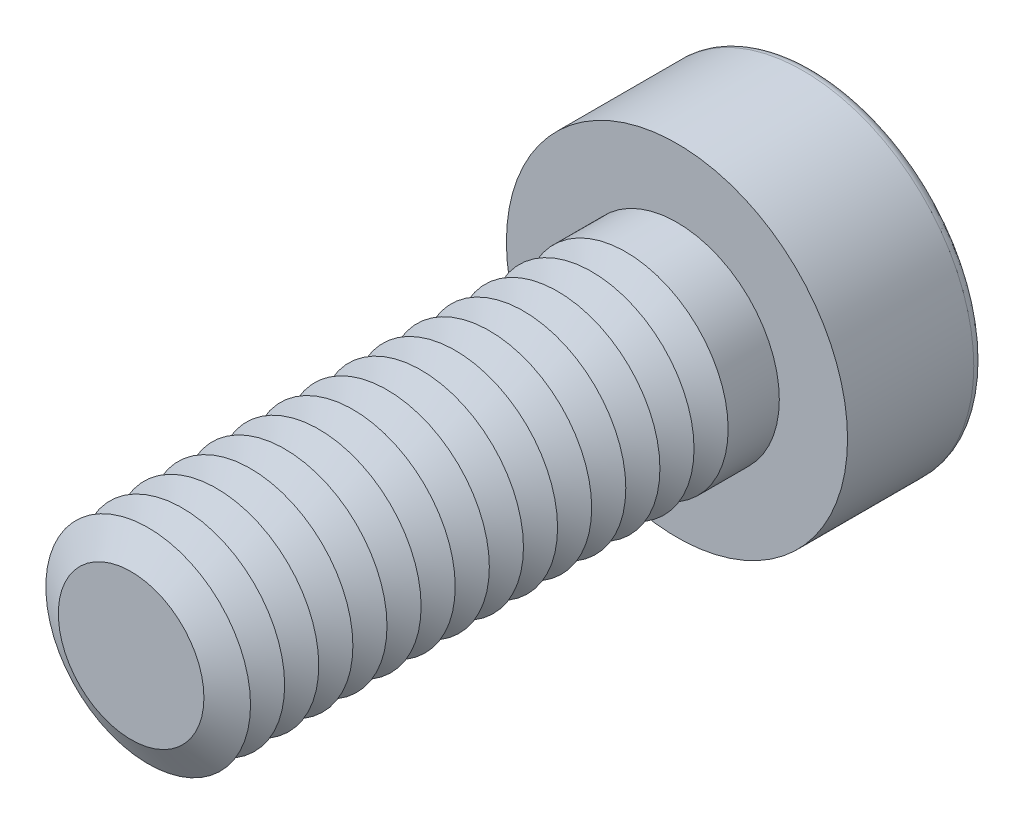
from build123d import *

# Parameters (mm, degrees)
SKETCH1_R           = 3
BOSS_EXTRUDE1_DEPTH = 16
SKETCH2_R           = 5
BOSS_EXTRUDE2_DEPTH = 4
CUT_EXTRUDE1_DEPTH  = 3
FILLET1_R           = 0.3
LPATTERN1_COUNT     = 15
LPATTERN1_PITCH     = 1


with BuildPart() as part:
    # Sketch1 → Boss-Extrude1 (new body)
    with BuildSketch(Plane.XY):
        Circle(SKETCH1_R)
    extrude(amount=BOSS_EXTRUDE1_DEPTH)

    # Sketch2 → Boss-Extrude2 (add)
    with BuildSketch(Plane(origin=(0, 0, 0), x_dir=(-1, 0, 0), z_dir=(0, 0, -1))):
        Circle(SKETCH2_R)
    extrude(amount=BOSS_EXTRUDE2_DEPTH)

    # Sketch3 → Cut-Extrude1 (cut)
    with BuildSketch(Plane(origin=(0, 0, -4), x_dir=(-1, 0, 0), z_dir=(0, 0, -1))):
        Polygon((-1.154700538, 2), (-2.309401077, 0), (-1.154700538, -2), (1.154700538, -2), (2.309401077, 0), (1.154700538, 2), align=None)
    extrude(amount=-CUT_EXTRUDE1_DEPTH, mode=Mode.SUBTRACT)

    # Fillet1
    fillet1_edges = [part.edges().sort_by_distance(p)[0] for p in [
        (5, 0, -4),
    ]]
    fillet(fillet1_edges, radius=FILLET1_R)

    # Cut-Extrude2 cone 1 section (on through the dimple's axis) → Cut-Extrude2 (revolve, cut)
    with BuildSketch(Plane(origin=(0, 0, -1), x_dir=(0, 1, 0), z_dir=(1, 0, 0))):
        Polygon((0, 0), (2, 0), (0, 1.154700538), align=None)
    revolve(axis=Axis((0, 0, -1), (0, 0, 1)), mode=Mode.SUBTRACT)

    # Cut-Extrude3 cone 1 section (on through the dimple's axis) → Cut-Extrude3 (revolve, cut)
    with BuildSketch(Plane(origin=(0, 0, -4), x_dir=(0, 1, 0), z_dir=(1, 0, 0))):
        Polygon((0, 0), (2.309401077, 0), (0, 0.618802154), align=None)
    revolve(axis=Axis((0, 0, -4), (0, 0, 1)), mode=Mode.SUBTRACT)

    # Sketch7 → Cut-Revolve1 (revolve, cut)
    with BuildSketch(Plane(origin=(0, 0, 0), x_dir=(0, 0, -1), z_dir=(1, 0, 0)), mode=Mode.PRIVATE) as cut_revolve1_sk:
        Polygon((-16, 2.133974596), (-15.5, 3), (-16.5, 3), align=None)
    cut_revolve1 = revolve(cut_revolve1_sk.sketch.rotate(Axis((0, 0, 16), (0, 0, -1)), 90), axis=Axis((0, 0, 16), (0, 0, -1)), mode=Mode.SUBTRACT)

    # LPattern1: Cut-Revolve1 ×15
    with Locations(*[(0, 0, -i * LPATTERN1_PITCH) for i in range(1, LPATTERN1_COUNT)]):
        add(cut_revolve1, mode=Mode.SUBTRACT)


solid = part.part
